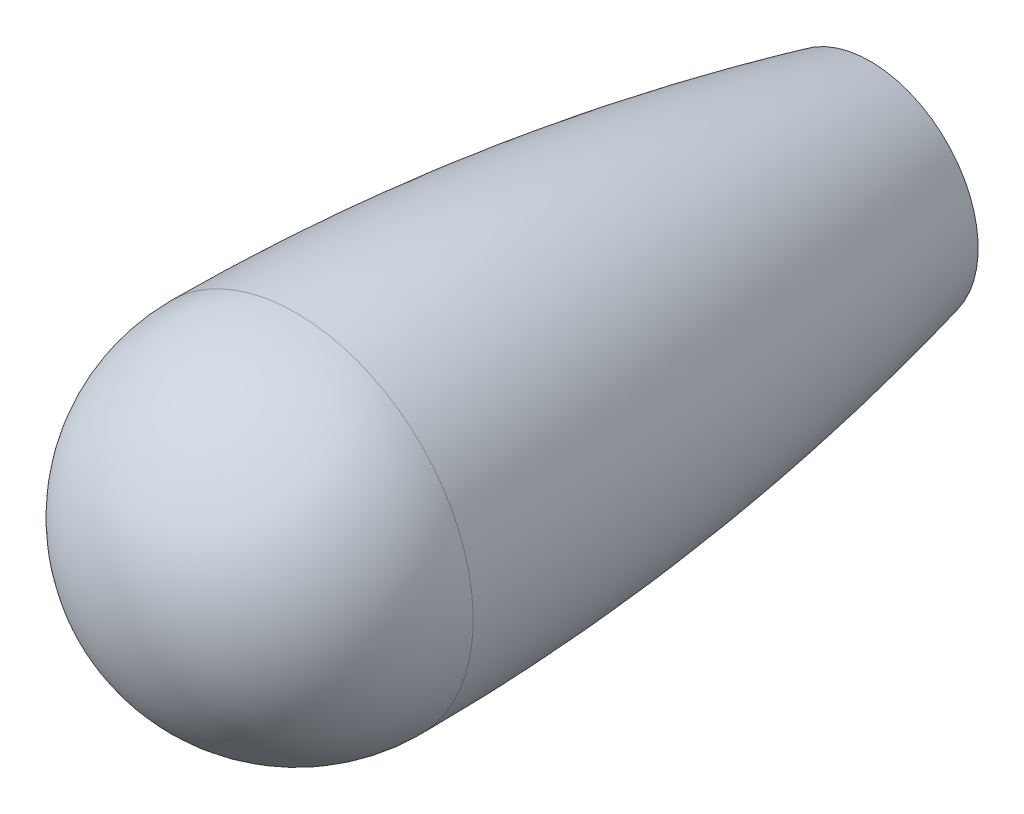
ISO-10303-21;
HEADER;
FILE_DESCRIPTION(('STEP AP214'),'2;1');
FILE_NAME('part.step','',(''),(''),'','','');
FILE_SCHEMA(('AUTOMOTIVE_DESIGN { 1 0 10303 214 1 1 1 1 }'));
ENDSEC;
DATA;
#1=APPLICATION_CONTEXT('core data for automotive mechanical design processes');
#2=APPLICATION_PROTOCOL_DEFINITION('international standard','automotive_design',2000,#1);
#3=PRODUCT_CONTEXT('',#1,'mechanical');
#4=PRODUCT('Part','Part','',(#3));
#5=PRODUCT_RELATED_PRODUCT_CATEGORY('part','',(#4));
#6=PRODUCT_DEFINITION_FORMATION('','',#4);
#7=PRODUCT_DEFINITION_CONTEXT('part definition',#1,'design');
#8=PRODUCT_DEFINITION('design','',#6,#7);
#9=PRODUCT_DEFINITION_SHAPE('','',#8);
#10=(LENGTH_UNIT() NAMED_UNIT(*) SI_UNIT(.MILLI.,.METRE.));
#11=(NAMED_UNIT(*) PLANE_ANGLE_UNIT() SI_UNIT($,.RADIAN.));
#12=(NAMED_UNIT(*) SI_UNIT($,.STERADIAN.) SOLID_ANGLE_UNIT());
#13=UNCERTAINTY_MEASURE_WITH_UNIT(LENGTH_MEASURE(1.E-05),#10,'distance_accuracy_value','');
#14=(GEOMETRIC_REPRESENTATION_CONTEXT(3) GLOBAL_UNCERTAINTY_ASSIGNED_CONTEXT((#13)) GLOBAL_UNIT_ASSIGNED_CONTEXT((#10,
#11,#12)) REPRESENTATION_CONTEXT('',''));
#15=CARTESIAN_POINT('',(0.,0.,0.));
#16=DIRECTION('',(0.,0.,1.));
#17=DIRECTION('',(1.,0.,0.));
#18=AXIS2_PLACEMENT_3D('',#15,#16,#17);
#19=CARTESIAN_POINT('',(0.,3.46666666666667,58.));
#20=DIRECTION('',(0.,0.,-1.));
#21=DIRECTION('',(-1.,0.,0.));
#22=AXIS2_PLACEMENT_3D('',#19,#20,#21);
#23=PLANE('',#22);
#24=CARTESIAN_POINT('',(0.,0.,58.));
#25=DIRECTION('',(0.,0.,1.));
#26=DIRECTION('',(-1.,0.,0.));
#27=AXIS2_PLACEMENT_3D('',#24,#25,#26);
#28=CIRCLE('',#27,6.93333333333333);
#29=CARTESIAN_POINT('',(6.93333333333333,0.,58.));
#30=VERTEX_POINT('',#29);
#31=CARTESIAN_POINT('',(-6.93333333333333,0.,58.));
#32=VERTEX_POINT('',#31);
#33=EDGE_CURVE('E41',#30,#32,#28,.F.);
#34=ORIENTED_EDGE('',*,*,#33,.T.);
#35=CARTESIAN_POINT('',(0.,0.,58.));
#36=DIRECTION('',(0.,0.,1.));
#37=DIRECTION('',(0.,1.,0.));
#38=AXIS2_PLACEMENT_3D('',#35,#36,#37);
#39=CIRCLE('',#38,6.93333333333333);
#40=CARTESIAN_POINT('',(0.,6.93333333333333,58.));
#41=VERTEX_POINT('',#40);
#42=EDGE_CURVE('E44',#32,#41,#39,.F.);
#43=ORIENTED_EDGE('',*,*,#42,.T.);
#44=CARTESIAN_POINT('',(0.,0.,58.));
#45=DIRECTION('',(0.,0.,1.));
#46=DIRECTION('',(1.,0.,0.));
#47=AXIS2_PLACEMENT_3D('',#44,#45,#46);
#48=CIRCLE('',#47,6.93333333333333);
#49=EDGE_CURVE('E35',#41,#30,#48,.F.);
#50=ORIENTED_EDGE('',*,*,#49,.T.);
#51=EDGE_LOOP('',(#34,#43,#50));
#52=FACE_BOUND('',#51,.T.);
#53=ADVANCED_FACE('F14',(#52),#23,.T.);
#54=CARTESIAN_POINT('',(0.,0.,56.9333333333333));
#55=DIRECTION('',(0.,0.,-1.));
#56=DIRECTION('',(-1.,0.,0.));
#57=AXIS2_PLACEMENT_3D('',#54,#55,#56);
#58=TOROIDAL_SURFACE('',#57,6.93333333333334,1.06666666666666);
#59=ORIENTED_EDGE('',*,*,#42,.F.);
#60=ORIENTED_EDGE('',*,*,#33,.F.);
#61=ORIENTED_EDGE('',*,*,#49,.F.);
#62=EDGE_LOOP('',(#59,#60,#61));
#63=FACE_BOUND('',#62,.T.);
#64=CARTESIAN_POINT('',(0.,0.,56.9333333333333));
#65=DIRECTION('',(0.,0.,1.));
#66=DIRECTION('',(1.,0.,0.));
#67=AXIS2_PLACEMENT_3D('',#64,#65,#66);
#68=CIRCLE('',#67,8.);
#69=CARTESIAN_POINT('',(8.,0.,56.9333333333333));
#70=VERTEX_POINT('',#69);
#71=EDGE_CURVE('E75',#70,#70,#68,.F.);
#72=ORIENTED_EDGE('',*,*,#71,.T.);
#73=EDGE_LOOP('',(#72));
#74=FACE_BOUND('',#73,.T.);
#75=ADVANCED_FACE('F50',(#63,#74),#58,.F.);
#76=CARTESIAN_POINT('',(0.,0.,44.4166666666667));
#77=DIRECTION('',(0.,0.,1.));
#78=DIRECTION('',(1.,0.,0.));
#79=AXIS2_PLACEMENT_3D('',#76,#77,#78);
#80=CYLINDRICAL_SURFACE('',#79,8.);
#81=ORIENTED_EDGE('',*,*,#71,.F.);
#82=EDGE_LOOP('',(#81));
#83=FACE_BOUND('',#82,.T.);
#84=CARTESIAN_POINT('',(0.,0.,31.9));
#85=DIRECTION('',(0.,0.,1.));
#86=DIRECTION('',(1.,0.,0.));
#87=AXIS2_PLACEMENT_3D('',#84,#85,#86);
#88=CIRCLE('',#87,8.);
#89=CARTESIAN_POINT('',(8.,0.,31.9));
#90=VERTEX_POINT('',#89);
#91=EDGE_CURVE('E85',#90,#90,#88,.T.);
#92=ORIENTED_EDGE('',*,*,#91,.F.);
#93=EDGE_LOOP('',(#92));
#94=FACE_BOUND('',#93,.T.);
#95=ADVANCED_FACE('F69',(#83,#94),#80,.F.);
#96=CARTESIAN_POINT('',(0.,8.4,31.9));
#97=DIRECTION('',(0.,0.,-1.));
#98=DIRECTION('',(-1.,0.,0.));
#99=AXIS2_PLACEMENT_3D('',#96,#97,#98);
#100=PLANE('',#99);
#101=CARTESIAN_POINT('',(0.,0.,31.9));
#102=DIRECTION('',(0.,0.,1.));
#103=DIRECTION('',(1.,0.,0.));
#104=AXIS2_PLACEMENT_3D('',#101,#102,#103);
#105=CIRCLE('',#104,8.8);
#106=CARTESIAN_POINT('',(8.8,0.,31.9));
#107=VERTEX_POINT('',#106);
#108=EDGE_CURVE('E90',#107,#107,#105,.F.);
#109=ORIENTED_EDGE('',*,*,#108,.T.);
#110=EDGE_LOOP('',(#109));
#111=FACE_BOUND('',#110,.T.);
#112=ORIENTED_EDGE('',*,*,#91,.T.);
#113=EDGE_LOOP('',(#112));
#114=FACE_BOUND('',#113,.T.);
#115=ADVANCED_FACE('F111',(#111,#114),#100,.T.);
#116=CARTESIAN_POINT('',(0.,0.,16.35));
#117=DIRECTION('',(0.,0.,1.));
#118=DIRECTION('',(1.,0.,0.));
#119=AXIS2_PLACEMENT_3D('',#116,#117,#118);
#120=CYLINDRICAL_SURFACE('',#119,8.8);
#121=ORIENTED_EDGE('',*,*,#108,.F.);
#122=EDGE_LOOP('',(#121));
#123=FACE_BOUND('',#122,.T.);
#124=CARTESIAN_POINT('',(0.,0.,0.8));
#125=DIRECTION('',(0.,0.,-1.));
#126=DIRECTION('',(0.,1.,0.));
#127=AXIS2_PLACEMENT_3D('',#124,#125,#126);
#128=CIRCLE('',#127,8.8);
#129=CARTESIAN_POINT('',(0.,8.8,0.8));
#130=VERTEX_POINT('',#129);
#131=EDGE_CURVE('E86',#130,#130,#128,.T.);
#132=ORIENTED_EDGE('',*,*,#131,.T.);
#133=EDGE_LOOP('',(#132));
#134=FACE_BOUND('',#133,.T.);
#135=ADVANCED_FACE('F108',(#123,#134),#120,.F.);
#136=CARTESIAN_POINT('',(0.,0.,0.));
#137=DIRECTION('',(0.,0.,-1.));
#138=DIRECTION('',(-1.,0.,0.));
#139=AXIS2_PLACEMENT_3D('',#136,#137,#138);
#140=CONICAL_SURFACE('',#139,9.6,0.785398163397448);
#141=ORIENTED_EDGE('',*,*,#131,.F.);
#142=EDGE_LOOP('',(#141));
#143=FACE_BOUND('',#142,.T.);
#144=CARTESIAN_POINT('',(0.,0.,0.));
#145=DIRECTION('',(0.,0.,-1.));
#146=DIRECTION('',(-1.,0.,0.));
#147=AXIS2_PLACEMENT_3D('',#144,#145,#146);
#148=CIRCLE('',#147,9.6);
#149=CARTESIAN_POINT('',(-9.6,0.,0.));
#150=VERTEX_POINT('',#149);
#151=EDGE_CURVE('E89',#150,#150,#148,.F.);
#152=ORIENTED_EDGE('',*,*,#151,.F.);
#153=EDGE_LOOP('',(#152));
#154=FACE_BOUND('',#153,.T.);
#155=ADVANCED_FACE('F104',(#143,#154),#140,.F.);
#156=CARTESIAN_POINT('',(0.,0.,66.5));
#157=DIRECTION('',(0.,0.,1.));
#158=DIRECTION('',(0.,1.,0.));
#159=AXIS2_PLACEMENT_3D('',#156,#157,#158);
#160=SPHERICAL_SURFACE('',#159,20.5);
#161=CARTESIAN_POINT('',(0.,0.,87.));
#162=VERTEX_POINT('',#161);
#163=VERTEX_LOOP('',#162);
#164=FACE_BOUND('',#163,.T.);
#165=CARTESIAN_POINT('',(0.,0.,66.4999999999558));
#166=DIRECTION('',(0.,0.,-1.));
#167=DIRECTION('',(-1.,0.,0.));
#168=AXIS2_PLACEMENT_3D('',#165,#166,#167);
#169=CIRCLE('',#168,20.5000000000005);
#170=CARTESIAN_POINT('',(-20.5000000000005,0.,66.4999999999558));
#171=VERTEX_POINT('',#170);
#172=EDGE_CURVE('E24',#171,#171,#169,.T.);
#173=ORIENTED_EDGE('',*,*,#172,.F.);
#174=EDGE_LOOP('',(#173));
#175=FACE_BOUND('',#174,.T.);
#176=ADVANCED_FACE('F99',(#164,#175),#160,.T.);
#177=CARTESIAN_POINT('',(0.,11.05,0.));
#178=DIRECTION('',(0.,0.,-1.));
#179=DIRECTION('',(-1.,0.,0.));
#180=AXIS2_PLACEMENT_3D('',#177,#178,#179);
#181=PLANE('',#180);
#182=CARTESIAN_POINT('',(0.,0.,0.));
#183=DIRECTION('',(0.,0.,-1.));
#184=DIRECTION('',(-1.,0.,0.));
#185=AXIS2_PLACEMENT_3D('',#182,#183,#184);
#186=CIRCLE('',#185,12.5000000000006);
#187=CARTESIAN_POINT('',(-12.5000000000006,0.,0.));
#188=VERTEX_POINT('',#187);
#189=EDGE_CURVE('E9',#188,#188,#186,.F.);
#190=ORIENTED_EDGE('',*,*,#189,.F.);
#191=EDGE_LOOP('',(#190));
#192=FACE_BOUND('',#191,.T.);
#193=ORIENTED_EDGE('',*,*,#151,.T.);
#194=EDGE_LOOP('',(#193));
#195=FACE_BOUND('',#194,.T.);
#196=ADVANCED_FACE('F103',(#192,#195),#181,.T.);
#197=CARTESIAN_POINT('',(266.498898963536,0.,67.2949803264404));
#198=DIRECTION('',(0.,1.,0.));
#199=DIRECTION('',(-1.,0.,0.));
#200=AXIS2_PLACEMENT_3D('',#197,#198,#199);
#201=CIRCLE('',#200,287.);
#202=TRIMMED_CURVE('',#201,(PARAMETER_VALUE(-0.380261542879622)),
(PARAMETER_VALUE(0.380261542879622)),.T.,.PARAMETER.);
#203=CARTESIAN_POINT('',(0.,0.,67.2949803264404));
#204=DIRECTION('',(0.,0.,-1.));
#205=AXIS1_PLACEMENT('',#203,#204);
#206=SURFACE_OF_REVOLUTION('',#202,#205);
#207=ORIENTED_EDGE('',*,*,#172,.T.);
#208=EDGE_LOOP('',(#207));
#209=FACE_BOUND('',#208,.T.);
#210=ORIENTED_EDGE('',*,*,#189,.T.);
#211=EDGE_LOOP('',(#210));
#212=FACE_BOUND('',#211,.T.);
#213=ADVANCED_FACE('F123',(#209,#212),#206,.F.);
#214=CLOSED_SHELL('',(#53,#75,#95,#115,#135,#155,#176,#196,#213));
#215=MANIFOLD_SOLID_BREP('B1',#214);
#216=ADVANCED_BREP_SHAPE_REPRESENTATION('',(#18,#215),#14);
#217=SHAPE_DEFINITION_REPRESENTATION(#9,#216);
ENDSEC;
END-ISO-10303-21;
